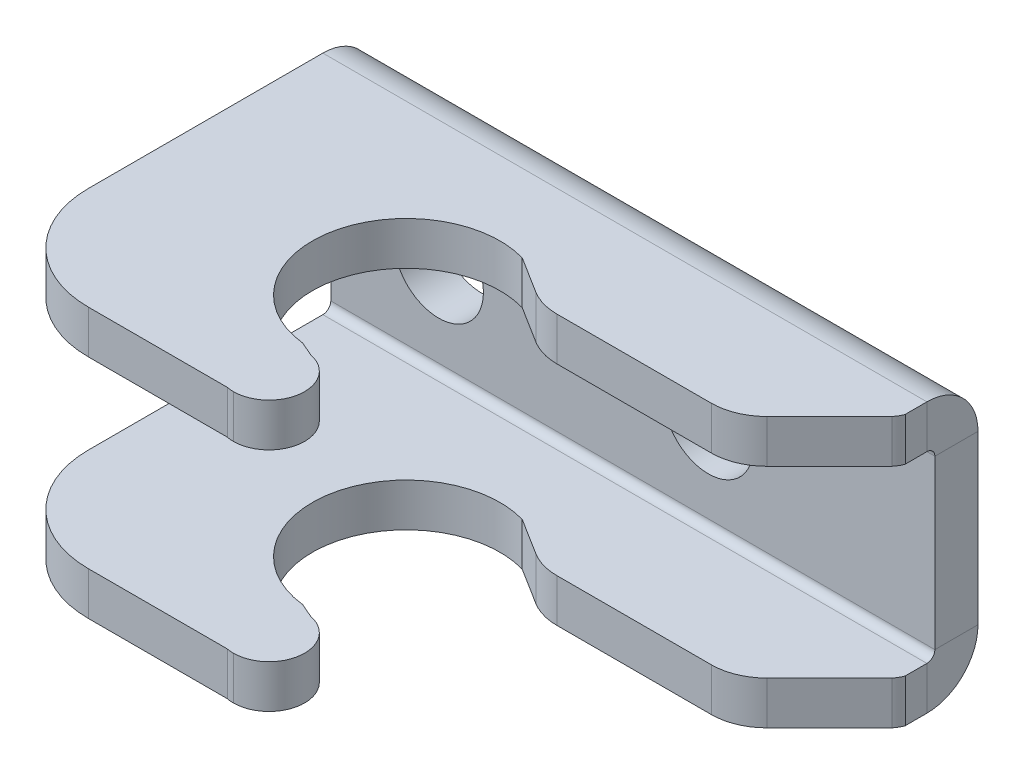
ISO-10303-21;
HEADER;
FILE_DESCRIPTION(('STEP AP214'),'2;1');
FILE_NAME('part.step','',(''),(''),'','','');
FILE_SCHEMA(('AUTOMOTIVE_DESIGN { 1 0 10303 214 1 1 1 1 }'));
ENDSEC;
DATA;
#1=APPLICATION_CONTEXT('core data for automotive mechanical design processes');
#2=APPLICATION_PROTOCOL_DEFINITION('international standard','automotive_design',2000,#1);
#3=PRODUCT_CONTEXT('',#1,'mechanical');
#4=PRODUCT('Part','Part','',(#3));
#5=PRODUCT_RELATED_PRODUCT_CATEGORY('part','',(#4));
#6=PRODUCT_DEFINITION_FORMATION('','',#4);
#7=PRODUCT_DEFINITION_CONTEXT('part definition',#1,'design');
#8=PRODUCT_DEFINITION('design','',#6,#7);
#9=PRODUCT_DEFINITION_SHAPE('','',#8);
#10=(LENGTH_UNIT() NAMED_UNIT(*) SI_UNIT(.MILLI.,.METRE.));
#11=(NAMED_UNIT(*) PLANE_ANGLE_UNIT() SI_UNIT($,.RADIAN.));
#12=(NAMED_UNIT(*) SI_UNIT($,.STERADIAN.) SOLID_ANGLE_UNIT());
#13=UNCERTAINTY_MEASURE_WITH_UNIT(LENGTH_MEASURE(1.E-05),#10,'distance_accuracy_value','');
#14=(GEOMETRIC_REPRESENTATION_CONTEXT(3) GLOBAL_UNCERTAINTY_ASSIGNED_CONTEXT((#13)) GLOBAL_UNIT_ASSIGNED_CONTEXT((#10,
#11,#12)) REPRESENTATION_CONTEXT('',''));
#15=CARTESIAN_POINT('',(0.,0.,0.));
#16=DIRECTION('',(0.,0.,1.));
#17=DIRECTION('',(1.,0.,0.));
#18=AXIS2_PLACEMENT_3D('',#15,#16,#17);
#19=CARTESIAN_POINT('',(13.0374425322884,8.5,32.7633807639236));
#20=DIRECTION('',(0.,1.,0.));
#21=DIRECTION('',(0.,0.,1.));
#22=AXIS2_PLACEMENT_3D('',#19,#20,#21);
#23=CYLINDRICAL_SURFACE('',#22,3.29825335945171);
#24=CARTESIAN_POINT('',(13.0374425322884,8.5,32.7633807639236));
#25=DIRECTION('',(0.,1.,0.));
#26=DIRECTION('',(0.,0.,-1.));
#27=AXIS2_PLACEMENT_3D('',#24,#25,#26);
#28=CIRCLE('',#27,3.29825335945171);
#29=CARTESIAN_POINT('',(12.4027999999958,8.5,36.));
#30=VERTEX_POINT('',#29);
#31=CARTESIAN_POINT('',(13.0374425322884,8.50000000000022,36.0616341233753));
#32=VERTEX_POINT('',#31);
#33=EDGE_CURVE('E9',#30,#32,#28,.T.);
#34=ORIENTED_EDGE('',*,*,#33,.T.);
#35=DIRECTION('',(0.,1.,0.));
#36=VECTOR('',#35,1.);
#37=CARTESIAN_POINT('',(13.0374425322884,8.50000000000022,36.0616341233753));
#38=LINE('',#37,#36);
#39=CARTESIAN_POINT('',(13.0374425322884,12.5,36.0616341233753));
#40=VERTEX_POINT('',#39);
#41=EDGE_CURVE('E25',#32,#40,#38,.T.);
#42=ORIENTED_EDGE('',*,*,#41,.T.);
#43=CARTESIAN_POINT('',(13.0374425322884,12.5,32.7633807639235));
#44=DIRECTION('',(0.,1.,0.));
#45=DIRECTION('',(0.,0.,-1.));
#46=AXIS2_PLACEMENT_3D('',#43,#44,#45);
#47=CIRCLE('',#46,3.29825335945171);
#48=CARTESIAN_POINT('',(12.4027999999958,12.5,36.));
#49=VERTEX_POINT('',#48);
#50=EDGE_CURVE('E417',#49,#40,#47,.T.);
#51=ORIENTED_EDGE('',*,*,#50,.F.);
#52=DIRECTION('',(0.,1.,0.));
#53=VECTOR('',#52,1.);
#54=CARTESIAN_POINT('',(12.4027999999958,8.5,36.));
#55=LINE('',#54,#53);
#56=EDGE_CURVE('E519',#30,#49,#55,.T.);
#57=ORIENTED_EDGE('',*,*,#56,.F.);
#58=EDGE_LOOP('',(#34,#42,#51,#57));
#59=FACE_BOUND('',#58,.T.);
#60=ADVANCED_FACE('F14',(#59),#23,.T.);
#61=CARTESIAN_POINT('',(13.0374425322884,-8.5,32.7633807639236));
#62=DIRECTION('',(0.,-1.,0.));
#63=DIRECTION('',(0.,0.,1.));
#64=AXIS2_PLACEMENT_3D('',#61,#62,#63);
#65=CYLINDRICAL_SURFACE('',#64,3.29825335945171);
#66=CARTESIAN_POINT('',(13.0374425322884,-8.5,32.7633807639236));
#67=DIRECTION('',(0.,1.,0.));
#68=DIRECTION('',(0.,0.,-1.));
#69=AXIS2_PLACEMENT_3D('',#66,#67,#68);
#70=CIRCLE('',#69,3.29825335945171);
#71=CARTESIAN_POINT('',(13.0374425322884,-8.5,36.0616341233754));
#72=VERTEX_POINT('',#71);
#73=CARTESIAN_POINT('',(13.6720850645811,-8.5,29.5267615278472));
#74=VERTEX_POINT('',#73);
#75=EDGE_CURVE('E485',#72,#74,#70,.T.);
#76=ORIENTED_EDGE('',*,*,#75,.F.);
#77=DIRECTION('',(0.,-1.,0.));
#78=VECTOR('',#77,1.);
#79=CARTESIAN_POINT('',(13.0374425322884,-8.5,36.0616341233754));
#80=LINE('',#79,#78);
#81=CARTESIAN_POINT('',(13.0374425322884,-12.5,36.0616341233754));
#82=VERTEX_POINT('',#81);
#83=EDGE_CURVE('E366',#72,#82,#80,.T.);
#84=ORIENTED_EDGE('',*,*,#83,.T.);
#85=CARTESIAN_POINT('',(13.0374425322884,-12.5,32.7633807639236));
#86=DIRECTION('',(0.,1.,0.));
#87=DIRECTION('',(0.,0.,-1.));
#88=AXIS2_PLACEMENT_3D('',#85,#86,#87);
#89=CIRCLE('',#88,3.29825335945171);
#90=CARTESIAN_POINT('',(13.6720850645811,-12.5,29.5267615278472));
#91=VERTEX_POINT('',#90);
#92=EDGE_CURVE('E362',#82,#91,#89,.T.);
#93=ORIENTED_EDGE('',*,*,#92,.T.);
#94=DIRECTION('',(0.,-1.,0.));
#95=VECTOR('',#94,1.);
#96=CARTESIAN_POINT('',(13.6720850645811,-8.5,29.5267615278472));
#97=LINE('',#96,#95);
#98=EDGE_CURVE('E566',#74,#91,#97,.T.);
#99=ORIENTED_EDGE('',*,*,#98,.F.);
#100=EDGE_LOOP('',(#76,#84,#93,#99));
#101=FACE_BOUND('',#100,.T.);
#102=ADVANCED_FACE('F953',(#101),#65,.T.);
#103=CARTESIAN_POINT('',(46.,-8.5,6.7366));
#104=DIRECTION('',(0.,0.,-1.));
#105=DIRECTION('',(0.,-1.,0.));
#106=AXIS2_PLACEMENT_3D('',#103,#104,#105);
#107=PLANE('',#106);
#108=DIRECTION('',(1.,0.,0.));
#109=VECTOR('',#108,1.);
#110=CARTESIAN_POINT('',(46.,-8.5,6.7366));
#111=LINE('',#110,#109);
#112=CARTESIAN_POINT('',(46.,-8.5,6.7366));
#113=VERTEX_POINT('',#112);
#114=CARTESIAN_POINT('',(46.0102060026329,-8.5,6.7366));
#115=VERTEX_POINT('',#114);
#116=EDGE_CURVE('E367',#113,#115,#111,.T.);
#117=ORIENTED_EDGE('',*,*,#116,.T.);
#118=DIRECTION('',(0.,-1.,0.));
#119=VECTOR('',#118,1.);
#120=CARTESIAN_POINT('',(46.0102060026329,-8.5,6.7366));
#121=LINE('',#120,#119);
#122=CARTESIAN_POINT('',(46.0102060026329,-12.5,6.7366));
#123=VERTEX_POINT('',#122);
#124=EDGE_CURVE('E459',#115,#123,#121,.T.);
#125=ORIENTED_EDGE('',*,*,#124,.T.);
#126=DIRECTION('',(-1.,0.,0.));
#127=VECTOR('',#126,1.);
#128=CARTESIAN_POINT('',(-0.475,-12.5,6.7366));
#129=LINE('',#128,#127);
#130=CARTESIAN_POINT('',(46.,-12.5,6.7366));
#131=VERTEX_POINT('',#130);
#132=EDGE_CURVE('E463',#123,#131,#129,.T.);
#133=ORIENTED_EDGE('',*,*,#132,.T.);
#134=DIRECTION('',(0.,-1.,0.));
#135=VECTOR('',#134,1.);
#136=CARTESIAN_POINT('',(46.,-8.5,6.7366));
#137=LINE('',#136,#135);
#138=EDGE_CURVE('E393',#113,#131,#137,.T.);
#139=ORIENTED_EDGE('',*,*,#138,.F.);
#140=EDGE_LOOP('',(#117,#125,#133,#139));
#141=FACE_BOUND('',#140,.T.);
#142=ADVANCED_FACE('F1002',(#141),#107,.T.);
#143=CARTESIAN_POINT('',(43.6124432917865,-8.5,5.89854631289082));
#144=DIRECTION('',(0.,-1.,0.));
#145=DIRECTION('',(0.,0.,1.));
#146=AXIS2_PLACEMENT_3D('',#143,#144,#145);
#147=CYLINDRICAL_SURFACE('',#146,2.54000000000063);
#148=ORIENTED_EDGE('',*,*,#124,.F.);
#149=CARTESIAN_POINT('',(43.6124432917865,-8.5,5.89854631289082));
#150=DIRECTION('',(0.,1.,0.));
#151=DIRECTION('',(0.,0.,-1.));
#152=AXIS2_PLACEMENT_3D('',#149,#150,#151);
#153=CIRCLE('',#152,2.54000000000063);
#154=CARTESIAN_POINT('',(45.5600523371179,-8.5,7.5290121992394));
#155=VERTEX_POINT('',#154);
#156=EDGE_CURVE('E440',#155,#115,#153,.T.);
#157=ORIENTED_EDGE('',*,*,#156,.F.);
#158=DIRECTION('',(0.,-1.,0.));
#159=VECTOR('',#158,1.);
#160=CARTESIAN_POINT('',(45.5600523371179,-8.5,7.5290121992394));
#161=LINE('',#160,#159);
#162=CARTESIAN_POINT('',(45.5600523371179,-12.5,7.5290121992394));
#163=VERTEX_POINT('',#162);
#164=EDGE_CURVE('E628',#155,#163,#161,.T.);
#165=ORIENTED_EDGE('',*,*,#164,.T.);
#166=CARTESIAN_POINT('',(43.6124432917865,-12.5,5.89854631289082));
#167=DIRECTION('',(0.,1.,0.));
#168=DIRECTION('',(0.,0.,-1.));
#169=AXIS2_PLACEMENT_3D('',#166,#167,#168);
#170=CIRCLE('',#169,2.54000000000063);
#171=EDGE_CURVE('E355',#163,#123,#170,.T.);
#172=ORIENTED_EDGE('',*,*,#171,.T.);
#173=EDGE_LOOP('',(#148,#157,#165,#172));
#174=FACE_BOUND('',#173,.T.);
#175=ADVANCED_FACE('F854',(#174),#147,.T.);
#176=CARTESIAN_POINT('',(46.,-8.5,1.63889215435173));
#177=DIRECTION('',(-1.,0.,0.));
#178=DIRECTION('',(0.,1.,0.));
#179=AXIS2_PLACEMENT_3D('',#176,#177,#178);
#180=PLANE('',#179);
#181=DIRECTION('',(0.,-1.,0.));
#182=VECTOR('',#181,1.);
#183=CARTESIAN_POINT('',(46.,-8.5,4.7366));
#184=LINE('',#183,#182);
#185=CARTESIAN_POINT('',(46.,-8.5,4.7366));
#186=VERTEX_POINT('',#185);
#187=CARTESIAN_POINT('',(46.,-12.5,4.7366));
#188=VERTEX_POINT('',#187);
#189=EDGE_CURVE('E464',#186,#188,#184,.T.);
#190=ORIENTED_EDGE('',*,*,#189,.F.);
#191=DIRECTION('',(0.,0.,-1.));
#192=VECTOR('',#191,1.);
#193=CARTESIAN_POINT('',(46.,-8.5,1.63889215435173));
#194=LINE('',#193,#192);
#195=EDGE_CURVE('E555',#113,#186,#194,.T.);
#196=ORIENTED_EDGE('',*,*,#195,.F.);
#197=ORIENTED_EDGE('',*,*,#138,.T.);
#198=DIRECTION('',(0.,0.,-1.));
#199=VECTOR('',#198,1.);
#200=CARTESIAN_POINT('',(46.,-12.5,1.63889215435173));
#201=LINE('',#200,#199);
#202=EDGE_CURVE('E387',#131,#188,#201,.T.);
#203=ORIENTED_EDGE('',*,*,#202,.T.);
#204=EDGE_LOOP('',(#190,#196,#197,#203));
#205=FACE_BOUND('',#204,.T.);
#206=ADVANCED_FACE('F872',(#205),#180,.F.);
#207=CARTESIAN_POINT('',(-10.,-8.5,26.275));
#208=DIRECTION('',(1.,0.,0.));
#209=DIRECTION('',(0.,0.,-1.));
#210=AXIS2_PLACEMENT_3D('',#207,#208,#209);
#211=PLANE('',#210);
#212=DIRECTION('',(0.,-1.,0.));
#213=VECTOR('',#212,1.);
#214=CARTESIAN_POINT('',(-10.,-8.5,4.7366));
#215=LINE('',#214,#213);
#216=CARTESIAN_POINT('',(-10.,-8.5,4.7366));
#217=VERTEX_POINT('',#216);
#218=CARTESIAN_POINT('',(-10.,-12.5,4.7366));
#219=VERTEX_POINT('',#218);
#220=EDGE_CURVE('E383',#217,#219,#215,.T.);
#221=ORIENTED_EDGE('',*,*,#220,.T.);
#222=DIRECTION('',(0.,0.,1.));
#223=VECTOR('',#222,1.);
#224=CARTESIAN_POINT('',(-10.,-12.5,26.275));
#225=LINE('',#224,#223);
#226=CARTESIAN_POINT('',(-10.,-12.5,26.475));
#227=VERTEX_POINT('',#226);
#228=EDGE_CURVE('E388',#219,#227,#225,.T.);
#229=ORIENTED_EDGE('',*,*,#228,.T.);
#230=DIRECTION('',(0.,-1.,0.));
#231=VECTOR('',#230,1.);
#232=CARTESIAN_POINT('',(-10.,-8.5,26.475));
#233=LINE('',#232,#231);
#234=CARTESIAN_POINT('',(-10.,-8.5,26.475));
#235=VERTEX_POINT('',#234);
#236=EDGE_CURVE('E574',#235,#227,#233,.T.);
#237=ORIENTED_EDGE('',*,*,#236,.F.);
#238=DIRECTION('',(0.,0.,1.));
#239=VECTOR('',#238,1.);
#240=CARTESIAN_POINT('',(-10.,-8.5,26.275));
#241=LINE('',#240,#239);
#242=EDGE_CURVE('E551',#217,#235,#241,.T.);
#243=ORIENTED_EDGE('',*,*,#242,.F.);
#244=EDGE_LOOP('',(#221,#229,#237,#243));
#245=FACE_BOUND('',#244,.T.);
#246=ADVANCED_FACE('F877',(#245),#211,.F.);
#247=CARTESIAN_POINT('',(-0.475,-8.5,26.475));
#248=DIRECTION('',(0.,1.,0.));
#249=DIRECTION('',(-1.,0.,0.));
#250=AXIS2_PLACEMENT_3D('',#247,#248,#249);
#251=PLANE('',#250);
#252=ORIENTED_EDGE('',*,*,#195,.T.);
#253=DIRECTION('',(1.,0.,0.));
#254=VECTOR('',#253,1.);
#255=CARTESIAN_POINT('',(-10.,-8.5,4.7366));
#256=LINE('',#255,#254);
#257=EDGE_CURVE('E532',#217,#186,#256,.T.);
#258=ORIENTED_EDGE('',*,*,#257,.F.);
#259=ORIENTED_EDGE('',*,*,#242,.T.);
#260=CARTESIAN_POINT('',(-0.475,-8.5,26.475));
#261=DIRECTION('',(0.,1.,0.));
#262=DIRECTION('',(0.,0.,-1.));
#263=AXIS2_PLACEMENT_3D('',#260,#261,#262);
#264=CIRCLE('',#263,9.525);
#265=CARTESIAN_POINT('',(-0.475,-8.5,36.));
#266=VERTEX_POINT('',#265);
#267=EDGE_CURVE('E556',#235,#266,#264,.T.);
#268=ORIENTED_EDGE('',*,*,#267,.T.);
#269=DIRECTION('',(1.,0.,0.));
#270=VECTOR('',#269,1.);
#271=CARTESIAN_POINT('',(12.4027999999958,-8.5,36.));
#272=LINE('',#271,#270);
#273=CARTESIAN_POINT('',(12.4027999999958,-8.5,36.));
#274=VERTEX_POINT('',#273);
#275=EDGE_CURVE('E548',#266,#274,#272,.T.);
#276=ORIENTED_EDGE('',*,*,#275,.T.);
#277=CARTESIAN_POINT('',(13.0374425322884,-8.5,32.7633807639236));
#278=DIRECTION('',(0.,1.,0.));
#279=DIRECTION('',(0.,0.,-1.));
#280=AXIS2_PLACEMENT_3D('',#277,#278,#279);
#281=CIRCLE('',#280,3.29825335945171);
#282=EDGE_CURVE('E544',#274,#72,#281,.T.);
#283=ORIENTED_EDGE('',*,*,#282,.T.);
#284=ORIENTED_EDGE('',*,*,#75,.T.);
#285=DIRECTION('',(-0.91749887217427,0.,-0.397738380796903));
#286=VECTOR('',#285,1.);
#287=CARTESIAN_POINT('',(13.6720850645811,-8.5,29.5267615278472));
#288=LINE('',#287,#286);
#289=CARTESIAN_POINT('',(12.3352961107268,-8.5,28.9472596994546));
#290=VERTEX_POINT('',#289);
#291=EDGE_CURVE('E481',#74,#290,#288,.T.);
#292=ORIENTED_EDGE('',*,*,#291,.T.);
#293=CARTESIAN_POINT('',(13.2917999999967,-8.5,20.3));
#294=DIRECTION('',(0.,-1.,0.));
#295=DIRECTION('',(0.,0.,-1.));
#296=AXIS2_PLACEMENT_3D('',#293,#294,#295);
#297=CIRCLE('',#296,8.7);
#298=CARTESIAN_POINT('',(15.6844512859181,-8.5,11.9354785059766));
#299=VERTEX_POINT('',#298);
#300=EDGE_CURVE('E486',#290,#299,#297,.T.);
#301=ORIENTED_EDGE('',*,*,#300,.T.);
#302=DIRECTION('',(0.84713861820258,0.,0.531371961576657));
#303=VECTOR('',#302,1.);
#304=CARTESIAN_POINT('',(15.6844512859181,-8.5,11.9354785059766));
#305=LINE('',#304,#303);
#306=CARTESIAN_POINT('',(19.0931873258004,-8.5,14.0736253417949));
#307=VERTEX_POINT('',#306);
#308=EDGE_CURVE('E490',#299,#307,#305,.T.);
#309=ORIENTED_EDGE('',*,*,#308,.T.);
#310=CARTESIAN_POINT('',(21.7979410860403,-8.5,9.68378416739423));
#311=DIRECTION('',(0.,1.,0.));
#312=DIRECTION('',(0.,0.,-1.));
#313=AXIS2_PLACEMENT_3D('',#310,#311,#312);
#314=CIRCLE('',#313,5.15619999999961);
#315=CARTESIAN_POINT('',(21.7979410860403,-8.5,14.8399841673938));
#316=VERTEX_POINT('',#315);
#317=EDGE_CURVE('E743',#307,#316,#314,.T.);
#318=ORIENTED_EDGE('',*,*,#317,.T.);
#319=DIRECTION('',(1.,0.,0.));
#320=VECTOR('',#319,1.);
#321=CARTESIAN_POINT('',(21.7979410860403,-8.5,14.8399841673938));
#322=LINE('',#321,#320);
#323=CARTESIAN_POINT('',(36.1133123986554,-8.5,14.8399841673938));
#324=VERTEX_POINT('',#323);
#325=EDGE_CURVE('E720',#316,#324,#322,.T.);
#326=ORIENTED_EDGE('',*,*,#325,.T.);
#327=CARTESIAN_POINT('',(36.1133123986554,-8.5,9.68378416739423));
#328=DIRECTION('',(0.,1.,0.));
#329=DIRECTION('',(0.,0.,-1.));
#330=AXIS2_PLACEMENT_3D('',#327,#328,#329);
#331=CIRCLE('',#330,5.15619999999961);
#332=CARTESIAN_POINT('',(39.7592963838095,-8.5,13.3297681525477));
#333=VERTEX_POINT('',#332);
#334=EDGE_CURVE('E716',#324,#333,#331,.T.);
#335=ORIENTED_EDGE('',*,*,#334,.T.);
#336=DIRECTION('',(0.707106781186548,0.,-0.707106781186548));
#337=VECTOR('',#336,1.);
#338=CARTESIAN_POINT('',(45.5600523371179,-8.5,7.5290121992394));
#339=LINE('',#338,#337);
#340=EDGE_CURVE('E721',#333,#155,#339,.T.);
#341=ORIENTED_EDGE('',*,*,#340,.T.);
#342=ORIENTED_EDGE('',*,*,#156,.T.);
#343=ORIENTED_EDGE('',*,*,#116,.F.);
#344=EDGE_LOOP('',(#252,#258,#259,#268,#276,#283,#284,#292,#301,#309,#318,#326,#335,#341,#342,#343));
#345=FACE_BOUND('',#344,.T.);
#346=ADVANCED_FACE('F645',(#345),#251,.T.);
#347=CARTESIAN_POINT('',(-0.475,-12.5,26.475));
#348=DIRECTION('',(0.,1.,0.));
#349=DIRECTION('',(-1.,0.,0.));
#350=AXIS2_PLACEMENT_3D('',#347,#348,#349);
#351=PLANE('',#350);
#352=DIRECTION('',(1.,0.,0.));
#353=VECTOR('',#352,1.);
#354=CARTESIAN_POINT('',(-10.,-12.5,4.7366));
#355=LINE('',#354,#353);
#356=EDGE_CURVE('E436',#219,#188,#355,.T.);
#357=ORIENTED_EDGE('',*,*,#356,.T.);
#358=ORIENTED_EDGE('',*,*,#202,.F.);
#359=ORIENTED_EDGE('',*,*,#132,.F.);
#360=ORIENTED_EDGE('',*,*,#171,.F.);
#361=DIRECTION('',(0.707106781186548,0.,-0.707106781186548));
#362=VECTOR('',#361,1.);
#363=CARTESIAN_POINT('',(45.5600523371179,-12.5,7.5290121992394));
#364=LINE('',#363,#362);
#365=CARTESIAN_POINT('',(39.7592963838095,-12.5,13.3297681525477));
#366=VERTEX_POINT('',#365);
#367=EDGE_CURVE('E739',#366,#163,#364,.T.);
#368=ORIENTED_EDGE('',*,*,#367,.F.);
#369=CARTESIAN_POINT('',(36.1133123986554,-12.5,9.68378416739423));
#370=DIRECTION('',(0.,1.,0.));
#371=DIRECTION('',(0.,0.,-1.));
#372=AXIS2_PLACEMENT_3D('',#369,#370,#371);
#373=CIRCLE('',#372,5.15619999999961);
#374=CARTESIAN_POINT('',(36.1133123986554,-12.5,14.8399841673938));
#375=VERTEX_POINT('',#374);
#376=EDGE_CURVE('E18',#375,#366,#373,.T.);
#377=ORIENTED_EDGE('',*,*,#376,.F.);
#378=DIRECTION('',(1.,0.,0.));
#379=VECTOR('',#378,1.);
#380=CARTESIAN_POINT('',(21.7979410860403,-12.5,14.8399841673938));
#381=LINE('',#380,#379);
#382=CARTESIAN_POINT('',(21.7979410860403,-12.5,14.8399841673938));
#383=VERTEX_POINT('',#382);
#384=EDGE_CURVE('E579',#383,#375,#381,.T.);
#385=ORIENTED_EDGE('',*,*,#384,.F.);
#386=CARTESIAN_POINT('',(21.7979410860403,-12.5,9.68378416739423));
#387=DIRECTION('',(0.,1.,0.));
#388=DIRECTION('',(0.,0.,-1.));
#389=AXIS2_PLACEMENT_3D('',#386,#387,#388);
#390=CIRCLE('',#389,5.15619999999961);
#391=CARTESIAN_POINT('',(19.0931873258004,-12.5,14.0736253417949));
#392=VERTEX_POINT('',#391);
#393=EDGE_CURVE('E373',#392,#383,#390,.T.);
#394=ORIENTED_EDGE('',*,*,#393,.F.);
#395=DIRECTION('',(0.84713861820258,0.,0.531371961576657));
#396=VECTOR('',#395,1.);
#397=CARTESIAN_POINT('',(15.6844512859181,-12.5,11.9354785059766));
#398=LINE('',#397,#396);
#399=CARTESIAN_POINT('',(15.6844512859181,-12.5,11.9354785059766));
#400=VERTEX_POINT('',#399);
#401=EDGE_CURVE('E372',#400,#392,#398,.T.);
#402=ORIENTED_EDGE('',*,*,#401,.F.);
#403=CARTESIAN_POINT('',(13.2917999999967,-12.5,20.3));
#404=DIRECTION('',(0.,-1.,0.));
#405=DIRECTION('',(0.,0.,-1.));
#406=AXIS2_PLACEMENT_3D('',#403,#404,#405);
#407=CIRCLE('',#406,8.7);
#408=CARTESIAN_POINT('',(12.3352961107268,-12.5,28.9472596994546));
#409=VERTEX_POINT('',#408);
#410=EDGE_CURVE('E562',#409,#400,#407,.T.);
#411=ORIENTED_EDGE('',*,*,#410,.F.);
#412=DIRECTION('',(-0.91749887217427,0.,-0.397738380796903));
#413=VECTOR('',#412,1.);
#414=CARTESIAN_POINT('',(13.6720850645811,-12.5,29.5267615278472));
#415=LINE('',#414,#413);
#416=EDGE_CURVE('E428',#91,#409,#415,.T.);
#417=ORIENTED_EDGE('',*,*,#416,.F.);
#418=ORIENTED_EDGE('',*,*,#92,.F.);
#419=CARTESIAN_POINT('',(13.0374425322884,-12.5,32.7633807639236));
#420=DIRECTION('',(0.,1.,0.));
#421=DIRECTION('',(0.,0.,-1.));
#422=AXIS2_PLACEMENT_3D('',#419,#420,#421);
#423=CIRCLE('',#422,3.29825335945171);
#424=CARTESIAN_POINT('',(12.4027999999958,-12.5,36.));
#425=VERTEX_POINT('',#424);
#426=EDGE_CURVE('E424',#425,#82,#423,.T.);
#427=ORIENTED_EDGE('',*,*,#426,.F.);
#428=DIRECTION('',(1.,0.,0.));
#429=VECTOR('',#428,1.);
#430=CARTESIAN_POINT('',(12.4027999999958,-12.5,36.));
#431=LINE('',#430,#429);
#432=CARTESIAN_POINT('',(-0.475,-12.5,36.));
#433=VERTEX_POINT('',#432);
#434=EDGE_CURVE('E599',#433,#425,#431,.T.);
#435=ORIENTED_EDGE('',*,*,#434,.F.);
#436=CARTESIAN_POINT('',(-0.475,-12.5,26.475));
#437=DIRECTION('',(0.,1.,0.));
#438=DIRECTION('',(0.,0.,-1.));
#439=AXIS2_PLACEMENT_3D('',#436,#437,#438);
#440=CIRCLE('',#439,9.525);
#441=EDGE_CURVE('E441',#227,#433,#440,.T.);
#442=ORIENTED_EDGE('',*,*,#441,.F.);
#443=ORIENTED_EDGE('',*,*,#228,.F.);
#444=EDGE_LOOP('',(#357,#358,#359,#360,#368,#377,#385,#394,#402,#411,#417,#418,#427,#435,#442,#443));
#445=FACE_BOUND('',#444,.T.);
#446=ADVANCED_FACE('F861',(#445),#351,.F.);
#447=CARTESIAN_POINT('',(-0.475,-8.5,26.475));
#448=DIRECTION('',(0.,-1.,0.));
#449=DIRECTION('',(0.,0.,1.));
#450=AXIS2_PLACEMENT_3D('',#447,#448,#449);
#451=CYLINDRICAL_SURFACE('',#450,9.525);
#452=ORIENTED_EDGE('',*,*,#441,.T.);
#453=DIRECTION('',(0.,-1.,0.));
#454=VECTOR('',#453,1.);
#455=CARTESIAN_POINT('',(-0.475,-8.5,36.));
#456=LINE('',#455,#454);
#457=EDGE_CURVE('E595',#266,#433,#456,.T.);
#458=ORIENTED_EDGE('',*,*,#457,.F.);
#459=ORIENTED_EDGE('',*,*,#267,.F.);
#460=ORIENTED_EDGE('',*,*,#236,.T.);
#461=EDGE_LOOP('',(#452,#458,#459,#460));
#462=FACE_BOUND('',#461,.T.);
#463=ADVANCED_FACE('F984',(#462),#451,.T.);
#464=CARTESIAN_POINT('',(12.4027999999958,-8.5,36.));
#465=DIRECTION('',(0.,0.,-1.));
#466=DIRECTION('',(1.,0.,0.));
#467=AXIS2_PLACEMENT_3D('',#464,#465,#466);
#468=PLANE('',#467);
#469=ORIENTED_EDGE('',*,*,#434,.T.);
#470=DIRECTION('',(0.,-1.,0.));
#471=VECTOR('',#470,1.);
#472=CARTESIAN_POINT('',(12.4027999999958,-8.5,36.));
#473=LINE('',#472,#471);
#474=EDGE_CURVE('E427',#274,#425,#473,.T.);
#475=ORIENTED_EDGE('',*,*,#474,.F.);
#476=ORIENTED_EDGE('',*,*,#275,.F.);
#477=ORIENTED_EDGE('',*,*,#457,.T.);
#478=EDGE_LOOP('',(#469,#475,#476,#477));
#479=FACE_BOUND('',#478,.T.);
#480=ADVANCED_FACE('F1099',(#479),#468,.F.);
#481=CARTESIAN_POINT('',(13.0374425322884,-8.5,32.7633807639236));
#482=DIRECTION('',(0.,-1.,0.));
#483=DIRECTION('',(0.,0.,1.));
#484=AXIS2_PLACEMENT_3D('',#481,#482,#483);
#485=CYLINDRICAL_SURFACE('',#484,3.29825335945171);
#486=ORIENTED_EDGE('',*,*,#83,.F.);
#487=ORIENTED_EDGE('',*,*,#282,.F.);
#488=ORIENTED_EDGE('',*,*,#474,.T.);
#489=ORIENTED_EDGE('',*,*,#426,.T.);
#490=EDGE_LOOP('',(#486,#487,#488,#489));
#491=FACE_BOUND('',#490,.T.);
#492=ADVANCED_FACE('F892',(#491),#485,.T.);
#493=CARTESIAN_POINT('',(13.6720850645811,-8.5,29.5267615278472));
#494=DIRECTION('',(-0.397738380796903,0.,0.91749887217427));
#495=DIRECTION('',(0.,1.,0.));
#496=AXIS2_PLACEMENT_3D('',#493,#494,#495);
#497=PLANE('',#496);
#498=ORIENTED_EDGE('',*,*,#416,.T.);
#499=DIRECTION('',(0.,-1.,0.));
#500=VECTOR('',#499,1.);
#501=CARTESIAN_POINT('',(12.3352961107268,-8.5,28.9472596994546));
#502=LINE('',#501,#500);
#503=EDGE_CURVE('E392',#290,#409,#502,.T.);
#504=ORIENTED_EDGE('',*,*,#503,.F.);
#505=ORIENTED_EDGE('',*,*,#291,.F.);
#506=ORIENTED_EDGE('',*,*,#98,.T.);
#507=EDGE_LOOP('',(#498,#504,#505,#506));
#508=FACE_BOUND('',#507,.T.);
#509=ADVANCED_FACE('F886',(#508),#497,.F.);
#510=CARTESIAN_POINT('',(13.2917999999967,-8.5,20.3));
#511=DIRECTION('',(0.,-1.,0.));
#512=DIRECTION('',(0.,0.,1.));
#513=AXIS2_PLACEMENT_3D('',#510,#511,#512);
#514=CYLINDRICAL_SURFACE('',#513,8.7);
#515=ORIENTED_EDGE('',*,*,#410,.T.);
#516=DIRECTION('',(0.,-1.,0.));
#517=VECTOR('',#516,1.);
#518=CARTESIAN_POINT('',(15.6844512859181,-8.5,11.9354785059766));
#519=LINE('',#518,#517);
#520=EDGE_CURVE('E368',#299,#400,#519,.T.);
#521=ORIENTED_EDGE('',*,*,#520,.F.);
#522=ORIENTED_EDGE('',*,*,#300,.F.);
#523=ORIENTED_EDGE('',*,*,#503,.T.);
#524=EDGE_LOOP('',(#515,#521,#522,#523));
#525=FACE_BOUND('',#524,.T.);
#526=ADVANCED_FACE('F891',(#525),#514,.F.);
#527=CARTESIAN_POINT('',(15.6844512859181,-8.5,11.9354785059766));
#528=DIRECTION('',(0.531371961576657,0.,-0.84713861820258));
#529=DIRECTION('',(0.84713861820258,0.,0.531371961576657));
#530=AXIS2_PLACEMENT_3D('',#527,#528,#529);
#531=PLANE('',#530);
#532=ORIENTED_EDGE('',*,*,#401,.T.);
#533=DIRECTION('',(0.,-1.,0.));
#534=VECTOR('',#533,1.);
#535=CARTESIAN_POINT('',(19.0931873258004,-8.5,14.0736253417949));
#536=LINE('',#535,#534);
#537=EDGE_CURVE('E575',#307,#392,#536,.T.);
#538=ORIENTED_EDGE('',*,*,#537,.F.);
#539=ORIENTED_EDGE('',*,*,#308,.F.);
#540=ORIENTED_EDGE('',*,*,#520,.T.);
#541=EDGE_LOOP('',(#532,#538,#539,#540));
#542=FACE_BOUND('',#541,.T.);
#543=ADVANCED_FACE('F1122',(#542),#531,.F.);
#544=CARTESIAN_POINT('',(21.7979410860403,-8.5,9.68378416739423));
#545=DIRECTION('',(0.,-1.,0.));
#546=DIRECTION('',(0.,0.,1.));
#547=AXIS2_PLACEMENT_3D('',#544,#545,#546);
#548=CYLINDRICAL_SURFACE('',#547,5.15619999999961);
#549=ORIENTED_EDGE('',*,*,#393,.T.);
#550=DIRECTION('',(0.,-1.,0.));
#551=VECTOR('',#550,1.);
#552=CARTESIAN_POINT('',(21.7979410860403,-8.5,14.8399841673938));
#553=LINE('',#552,#551);
#554=EDGE_CURVE('E591',#316,#383,#553,.T.);
#555=ORIENTED_EDGE('',*,*,#554,.F.);
#556=ORIENTED_EDGE('',*,*,#317,.F.);
#557=ORIENTED_EDGE('',*,*,#537,.T.);
#558=EDGE_LOOP('',(#549,#555,#556,#557));
#559=FACE_BOUND('',#558,.T.);
#560=ADVANCED_FACE('F1116',(#559),#548,.T.);
#561=CARTESIAN_POINT('',(21.7979410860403,-8.5,14.8399841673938));
#562=DIRECTION('',(0.,0.,-1.));
#563=DIRECTION('',(1.,0.,0.));
#564=AXIS2_PLACEMENT_3D('',#561,#562,#563);
#565=PLANE('',#564);
#566=ORIENTED_EDGE('',*,*,#384,.T.);
#567=DIRECTION('',(0.,-1.,0.));
#568=VECTOR('',#567,1.);
#569=CARTESIAN_POINT('',(36.1133123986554,-8.5,14.8399841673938));
#570=LINE('',#569,#568);
#571=EDGE_CURVE('E752',#324,#375,#570,.T.);
#572=ORIENTED_EDGE('',*,*,#571,.F.);
#573=ORIENTED_EDGE('',*,*,#325,.F.);
#574=ORIENTED_EDGE('',*,*,#554,.T.);
#575=EDGE_LOOP('',(#566,#572,#573,#574));
#576=FACE_BOUND('',#575,.T.);
#577=ADVANCED_FACE('F1121',(#576),#565,.F.);
#578=CARTESIAN_POINT('',(36.1133123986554,-8.5,9.68378416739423));
#579=DIRECTION('',(0.,-1.,0.));
#580=DIRECTION('',(0.,0.,1.));
#581=AXIS2_PLACEMENT_3D('',#578,#579,#580);
#582=CYLINDRICAL_SURFACE('',#581,5.15619999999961);
#583=ORIENTED_EDGE('',*,*,#376,.T.);
#584=DIRECTION('',(0.,-1.,0.));
#585=VECTOR('',#584,1.);
#586=CARTESIAN_POINT('',(39.7592963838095,-8.5,13.3297681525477));
#587=LINE('',#586,#585);
#588=EDGE_CURVE('E467',#333,#366,#587,.T.);
#589=ORIENTED_EDGE('',*,*,#588,.F.);
#590=ORIENTED_EDGE('',*,*,#334,.F.);
#591=ORIENTED_EDGE('',*,*,#571,.T.);
#592=EDGE_LOOP('',(#583,#589,#590,#591));
#593=FACE_BOUND('',#592,.T.);
#594=ADVANCED_FACE('F16',(#593),#582,.T.);
#595=CARTESIAN_POINT('',(45.5600523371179,-8.5,7.5290121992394));
#596=DIRECTION('',(-0.707106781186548,0.,-0.707106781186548));
#597=DIRECTION('',(0.,-1.,0.));
#598=AXIS2_PLACEMENT_3D('',#595,#596,#597);
#599=PLANE('',#598);
#600=ORIENTED_EDGE('',*,*,#367,.T.);
#601=ORIENTED_EDGE('',*,*,#164,.F.);
#602=ORIENTED_EDGE('',*,*,#340,.F.);
#603=ORIENTED_EDGE('',*,*,#588,.T.);
#604=EDGE_LOOP('',(#600,#601,#602,#603));
#605=FACE_BOUND('',#604,.T.);
#606=ADVANCED_FACE('F857',(#605),#599,.F.);
#607=CARTESIAN_POINT('',(46.,-7.7634,4.7366));
#608=DIRECTION('',(1.,0.,0.));
#609=DIRECTION('',(0.,0.,-1.));
#610=AXIS2_PLACEMENT_3D('',#607,#608,#609);
#611=PLANE('',#610);
#612=DIRECTION('',(0.,0.,-1.));
#613=VECTOR('',#612,1.);
#614=CARTESIAN_POINT('',(46.,-7.7634,0.));
#615=LINE('',#614,#613);
#616=CARTESIAN_POINT('',(46.,-7.7634,4.));
#617=VERTEX_POINT('',#616);
#618=CARTESIAN_POINT('',(46.,-7.7634,0.));
#619=VERTEX_POINT('',#618);
#620=EDGE_CURVE('E455',#617,#619,#615,.T.);
#621=ORIENTED_EDGE('',*,*,#620,.F.);
#622=CARTESIAN_POINT('',(46.,-7.7634,4.7366));
#623=DIRECTION('',(1.,0.,0.));
#624=DIRECTION('',(0.,0.,1.));
#625=AXIS2_PLACEMENT_3D('',#622,#623,#624);
#626=CIRCLE('',#625,0.7366);
#627=EDGE_CURVE('E528',#186,#617,#626,.T.);
#628=ORIENTED_EDGE('',*,*,#627,.F.);
#629=ORIENTED_EDGE('',*,*,#189,.T.);
#630=CARTESIAN_POINT('',(46.,-7.7634,4.7366));
#631=DIRECTION('',(1.,0.,0.));
#632=DIRECTION('',(0.,0.,1.));
#633=AXIS2_PLACEMENT_3D('',#630,#631,#632);
#634=CIRCLE('',#633,4.7366);
#635=EDGE_CURVE('E468',#188,#619,#634,.T.);
#636=ORIENTED_EDGE('',*,*,#635,.T.);
#637=EDGE_LOOP('',(#621,#628,#629,#636));
#638=FACE_BOUND('',#637,.T.);
#639=ADVANCED_FACE('F651',(#638),#611,.T.);
#640=CARTESIAN_POINT('',(-10.,-7.7634,4.7366));
#641=DIRECTION('',(1.,0.,0.));
#642=DIRECTION('',(0.,0.,-1.));
#643=AXIS2_PLACEMENT_3D('',#640,#641,#642);
#644=PLANE('',#643);
#645=CARTESIAN_POINT('',(-10.,-7.7634,4.7366));
#646=DIRECTION('',(-1.,0.,0.));
#647=DIRECTION('',(0.,0.,1.));
#648=AXIS2_PLACEMENT_3D('',#645,#646,#647);
#649=CIRCLE('',#648,0.7366);
#650=CARTESIAN_POINT('',(-10.,-7.7634,4.));
#651=VERTEX_POINT('',#650);
#652=EDGE_CURVE('E256',#651,#217,#649,.T.);
#653=ORIENTED_EDGE('',*,*,#652,.F.);
#654=DIRECTION('',(0.,0.,-1.));
#655=VECTOR('',#654,1.);
#656=CARTESIAN_POINT('',(-10.,-7.7634,4.));
#657=LINE('',#656,#655);
#658=CARTESIAN_POINT('',(-10.,-7.7634,0.));
#659=VERTEX_POINT('',#658);
#660=EDGE_CURVE('E606',#651,#659,#657,.T.);
#661=ORIENTED_EDGE('',*,*,#660,.T.);
#662=CARTESIAN_POINT('',(-10.,-7.7634,4.7366));
#663=DIRECTION('',(-1.,0.,0.));
#664=DIRECTION('',(0.,0.,1.));
#665=AXIS2_PLACEMENT_3D('',#662,#663,#664);
#666=CIRCLE('',#665,4.7366);
#667=EDGE_CURVE('E755',#659,#219,#666,.T.);
#668=ORIENTED_EDGE('',*,*,#667,.T.);
#669=ORIENTED_EDGE('',*,*,#220,.F.);
#670=EDGE_LOOP('',(#653,#661,#668,#669));
#671=FACE_BOUND('',#670,.T.);
#672=ADVANCED_FACE('F964',(#671),#644,.F.);
#673=CARTESIAN_POINT('',(-10.,-7.7634,4.7366));
#674=DIRECTION('',(-1.,0.,0.));
#675=DIRECTION('',(0.,0.,-1.));
#676=AXIS2_PLACEMENT_3D('',#673,#674,#675);
#677=CYLINDRICAL_SURFACE('',#676,4.7366);
#678=ORIENTED_EDGE('',*,*,#356,.F.);
#679=ORIENTED_EDGE('',*,*,#667,.F.);
#680=DIRECTION('',(-1.,0.,0.));
#681=VECTOR('',#680,1.);
#682=CARTESIAN_POINT('',(46.,-7.7634,0.));
#683=LINE('',#682,#681);
#684=EDGE_CURVE('E240',#619,#659,#683,.T.);
#685=ORIENTED_EDGE('',*,*,#684,.F.);
#686=ORIENTED_EDGE('',*,*,#635,.F.);
#687=EDGE_LOOP('',(#678,#679,#685,#686));
#688=FACE_BOUND('',#687,.T.);
#689=ADVANCED_FACE('F1131',(#688),#677,.T.);
#690=CARTESIAN_POINT('',(-10.,-7.7634,4.7366));
#691=DIRECTION('',(-1.,0.,0.));
#692=DIRECTION('',(0.,0.,-1.));
#693=AXIS2_PLACEMENT_3D('',#690,#691,#692);
#694=CYLINDRICAL_SURFACE('',#693,0.7366);
#695=ORIENTED_EDGE('',*,*,#257,.T.);
#696=ORIENTED_EDGE('',*,*,#627,.T.);
#697=DIRECTION('',(-1.,0.,0.));
#698=VECTOR('',#697,1.);
#699=CARTESIAN_POINT('',(46.,-7.7634,4.));
#700=LINE('',#699,#698);
#701=EDGE_CURVE('E533',#617,#651,#700,.T.);
#702=ORIENTED_EDGE('',*,*,#701,.T.);
#703=ORIENTED_EDGE('',*,*,#652,.T.);
#704=EDGE_LOOP('',(#695,#696,#702,#703));
#705=FACE_BOUND('',#704,.T.);
#706=ADVANCED_FACE('F654',(#705),#694,.F.);
#707=CARTESIAN_POINT('',(-10.,0.,0.));
#708=DIRECTION('',(1.,0.,0.));
#709=DIRECTION('',(0.,0.,-1.));
#710=AXIS2_PLACEMENT_3D('',#707,#708,#709);
#711=PLANE('',#710);
#712=ORIENTED_EDGE('',*,*,#660,.F.);
#713=DIRECTION('',(0.,1.,0.));
#714=VECTOR('',#713,1.);
#715=CARTESIAN_POINT('',(-10.,0.,4.));
#716=LINE('',#715,#714);
#717=CARTESIAN_POINT('',(-10.,7.7634,3.99999999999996));
#718=VERTEX_POINT('',#717);
#719=EDGE_CURVE('E728',#651,#718,#716,.T.);
#720=ORIENTED_EDGE('',*,*,#719,.T.);
#721=DIRECTION('',(0.,0.,-1.));
#722=VECTOR('',#721,1.);
#723=CARTESIAN_POINT('',(-10.,7.7634,3.99999999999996));
#724=LINE('',#723,#722);
#725=CARTESIAN_POINT('',(-10.,7.7634,0.));
#726=VERTEX_POINT('',#725);
#727=EDGE_CURVE('E732',#718,#726,#724,.T.);
#728=ORIENTED_EDGE('',*,*,#727,.T.);
#729=DIRECTION('',(0.,1.,0.));
#730=VECTOR('',#729,1.);
#731=CARTESIAN_POINT('',(-10.,-8.5,0.));
#732=LINE('',#731,#730);
#733=EDGE_CURVE('E507',#659,#726,#732,.T.);
#734=ORIENTED_EDGE('',*,*,#733,.F.);
#735=EDGE_LOOP('',(#712,#720,#728,#734));
#736=FACE_BOUND('',#735,.T.);
#737=ADVANCED_FACE('F822',(#736),#711,.F.);
#738=CARTESIAN_POINT('',(46.,-8.5,0.));
#739=DIRECTION('',(-1.,0.,0.));
#740=DIRECTION('',(0.,1.,0.));
#741=AXIS2_PLACEMENT_3D('',#738,#739,#740);
#742=PLANE('',#741);
#743=ORIENTED_EDGE('',*,*,#620,.T.);
#744=DIRECTION('',(0.,-1.,0.));
#745=VECTOR('',#744,1.);
#746=CARTESIAN_POINT('',(46.,-8.5,0.));
#747=LINE('',#746,#745);
#748=CARTESIAN_POINT('',(46.,7.7634,0.));
#749=VERTEX_POINT('',#748);
#750=EDGE_CURVE('E456',#749,#619,#747,.T.);
#751=ORIENTED_EDGE('',*,*,#750,.F.);
#752=DIRECTION('',(0.,0.,-1.));
#753=VECTOR('',#752,1.);
#754=CARTESIAN_POINT('',(46.,7.7634,0.));
#755=LINE('',#754,#753);
#756=CARTESIAN_POINT('',(46.,7.7634,3.99999999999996));
#757=VERTEX_POINT('',#756);
#758=EDGE_CURVE('E494',#757,#749,#755,.T.);
#759=ORIENTED_EDGE('',*,*,#758,.F.);
#760=DIRECTION('',(0.,-1.,0.));
#761=VECTOR('',#760,1.);
#762=CARTESIAN_POINT('',(46.,-8.5,4.));
#763=LINE('',#762,#761);
#764=EDGE_CURVE('E451',#757,#617,#763,.T.);
#765=ORIENTED_EDGE('',*,*,#764,.T.);
#766=EDGE_LOOP('',(#743,#751,#759,#765));
#767=FACE_BOUND('',#766,.T.);
#768=ADVANCED_FACE('F659',(#767),#742,.F.);
#769=CARTESIAN_POINT('',(46.,-8.5,0.));
#770=DIRECTION('',(0.,0.,-1.));
#771=DIRECTION('',(0.,-1.,0.));
#772=AXIS2_PLACEMENT_3D('',#769,#770,#771);
#773=PLANE('',#772);
#774=CARTESIAN_POINT('',(0.,0.,0.));
#775=DIRECTION('',(0.,0.,-1.));
#776=DIRECTION('',(0.,1.,0.));
#777=AXIS2_PLACEMENT_3D('',#774,#775,#776);
#778=CIRCLE('',#777,4.15);
#779=CARTESIAN_POINT('',(0.,4.15,0.));
#780=VERTEX_POINT('',#779);
#781=EDGE_CURVE('E435',#780,#780,#778,.T.);
#782=ORIENTED_EDGE('',*,*,#781,.F.);
#783=EDGE_LOOP('',(#782));
#784=FACE_BOUND('',#783,.T.);
#785=CARTESIAN_POINT('',(25.,0.,0.));
#786=DIRECTION('',(0.,0.,-1.));
#787=DIRECTION('',(0.,1.,0.));
#788=AXIS2_PLACEMENT_3D('',#785,#786,#787);
#789=CIRCLE('',#788,4.15);
#790=CARTESIAN_POINT('',(25.,4.15,0.));
#791=VERTEX_POINT('',#790);
#792=EDGE_CURVE('E1586',#791,#791,#789,.T.);
#793=ORIENTED_EDGE('',*,*,#792,.F.);
#794=EDGE_LOOP('',(#793));
#795=FACE_BOUND('',#794,.T.);
#796=ORIENTED_EDGE('',*,*,#750,.T.);
#797=ORIENTED_EDGE('',*,*,#684,.T.);
#798=ORIENTED_EDGE('',*,*,#733,.T.);
#799=DIRECTION('',(-1.,0.,0.));
#800=VECTOR('',#799,1.);
#801=CARTESIAN_POINT('',(46.,7.7634,0.));
#802=LINE('',#801,#800);
#803=EDGE_CURVE('E434',#749,#726,#802,.T.);
#804=ORIENTED_EDGE('',*,*,#803,.F.);
#805=EDGE_LOOP('',(#796,#797,#798,#804));
#806=FACE_BOUND('',#805,.T.);
#807=ADVANCED_FACE('F819',(#784,#795,#806),#773,.T.);
#808=CARTESIAN_POINT('',(46.,-8.5,4.));
#809=DIRECTION('',(0.,0.,-1.));
#810=DIRECTION('',(0.,-1.,0.));
#811=AXIS2_PLACEMENT_3D('',#808,#809,#810);
#812=PLANE('',#811);
#813=CARTESIAN_POINT('',(0.,0.,4.));
#814=DIRECTION('',(0.,0.,1.));
#815=DIRECTION('',(1.,0.,0.));
#816=AXIS2_PLACEMENT_3D('',#813,#814,#815);
#817=CIRCLE('',#816,4.15);
#818=CARTESIAN_POINT('',(4.15,0.,4.));
#819=VERTEX_POINT('',#818);
#820=EDGE_CURVE('E1589',#819,#819,#817,.T.);
#821=ORIENTED_EDGE('',*,*,#820,.F.);
#822=EDGE_LOOP('',(#821));
#823=FACE_BOUND('',#822,.T.);
#824=CARTESIAN_POINT('',(25.,0.,4.));
#825=DIRECTION('',(0.,0.,1.));
#826=DIRECTION('',(1.,0.,0.));
#827=AXIS2_PLACEMENT_3D('',#824,#825,#826);
#828=CIRCLE('',#827,4.15);
#829=CARTESIAN_POINT('',(29.15,0.,4.));
#830=VERTEX_POINT('',#829);
#831=EDGE_CURVE('E1590',#830,#830,#828,.T.);
#832=ORIENTED_EDGE('',*,*,#831,.F.);
#833=EDGE_LOOP('',(#832));
#834=FACE_BOUND('',#833,.T.);
#835=ORIENTED_EDGE('',*,*,#701,.F.);
#836=ORIENTED_EDGE('',*,*,#764,.F.);
#837=DIRECTION('',(-1.,0.,0.));
#838=VECTOR('',#837,1.);
#839=CARTESIAN_POINT('',(46.,7.7634,3.99999999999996));
#840=LINE('',#839,#838);
#841=EDGE_CURVE('E538',#757,#718,#840,.T.);
#842=ORIENTED_EDGE('',*,*,#841,.T.);
#843=ORIENTED_EDGE('',*,*,#719,.F.);
#844=EDGE_LOOP('',(#835,#836,#842,#843));
#845=FACE_BOUND('',#844,.T.);
#846=ADVANCED_FACE('F664',(#823,#834,#845),#812,.F.);
#847=CARTESIAN_POINT('',(46.,8.5,6.7366));
#848=DIRECTION('',(0.,0.,-1.));
#849=DIRECTION('',(0.,-1.,0.));
#850=AXIS2_PLACEMENT_3D('',#847,#848,#849);
#851=PLANE('',#850);
#852=DIRECTION('',(1.,0.,0.));
#853=VECTOR('',#852,1.);
#854=CARTESIAN_POINT('',(46.,8.5,6.7366));
#855=LINE('',#854,#853);
#856=CARTESIAN_POINT('',(46.,8.5,6.7366));
#857=VERTEX_POINT('',#856);
#858=CARTESIAN_POINT('',(46.0102060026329,8.5,6.7366));
#859=VERTEX_POINT('',#858);
#860=EDGE_CURVE('E382',#857,#859,#855,.T.);
#861=ORIENTED_EDGE('',*,*,#860,.F.);
#862=DIRECTION('',(0.,1.,0.));
#863=VECTOR('',#862,1.);
#864=CARTESIAN_POINT('',(46.,8.5,6.7366));
#865=LINE('',#864,#863);
#866=CARTESIAN_POINT('',(46.,12.5,6.7366));
#867=VERTEX_POINT('',#866);
#868=EDGE_CURVE('E534',#857,#867,#865,.T.);
#869=ORIENTED_EDGE('',*,*,#868,.T.);
#870=DIRECTION('',(-1.,0.,0.));
#871=VECTOR('',#870,1.);
#872=CARTESIAN_POINT('',(-0.475,12.5,6.73659999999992));
#873=LINE('',#872,#871);
#874=CARTESIAN_POINT('',(46.0102060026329,12.5,6.73659999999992));
#875=VERTEX_POINT('',#874);
#876=EDGE_CURVE('E480',#875,#867,#873,.T.);
#877=ORIENTED_EDGE('',*,*,#876,.F.);
#878=DIRECTION('',(0.,1.,0.));
#879=VECTOR('',#878,1.);
#880=CARTESIAN_POINT('',(46.0102060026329,8.5,6.7366));
#881=LINE('',#880,#879);
#882=EDGE_CURVE('E401',#859,#875,#881,.T.);
#883=ORIENTED_EDGE('',*,*,#882,.F.);
#884=EDGE_LOOP('',(#861,#869,#877,#883));
#885=FACE_BOUND('',#884,.T.);
#886=ADVANCED_FACE('F836',(#885),#851,.T.);
#887=CARTESIAN_POINT('',(43.6124432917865,8.5,5.89854631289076));
#888=DIRECTION('',(0.,1.,0.));
#889=DIRECTION('',(0.,0.,1.));
#890=AXIS2_PLACEMENT_3D('',#887,#888,#889);
#891=CYLINDRICAL_SURFACE('',#890,2.54000000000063);
#892=ORIENTED_EDGE('',*,*,#882,.T.);
#893=CARTESIAN_POINT('',(43.6124432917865,12.5,5.89854631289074));
#894=DIRECTION('',(0.,1.,0.));
#895=DIRECTION('',(0.,0.,-1.));
#896=AXIS2_PLACEMENT_3D('',#893,#894,#895);
#897=CIRCLE('',#896,2.54000000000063);
#898=CARTESIAN_POINT('',(45.5600523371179,12.5,7.52901219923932));
#899=VERTEX_POINT('',#898);
#900=EDGE_CURVE('E475',#899,#875,#897,.T.);
#901=ORIENTED_EDGE('',*,*,#900,.F.);
#902=DIRECTION('',(0.,1.,0.));
#903=VECTOR('',#902,1.);
#904=CARTESIAN_POINT('',(45.5600523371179,8.5,7.52901219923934));
#905=LINE('',#904,#903);
#906=CARTESIAN_POINT('',(45.5600523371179,8.5,7.52901219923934));
#907=VERTEX_POINT('',#906);
#908=EDGE_CURVE('E583',#907,#899,#905,.T.);
#909=ORIENTED_EDGE('',*,*,#908,.F.);
#910=CARTESIAN_POINT('',(43.6124432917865,8.5,5.89854631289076));
#911=DIRECTION('',(0.,1.,0.));
#912=DIRECTION('',(0.,0.,-1.));
#913=AXIS2_PLACEMENT_3D('',#910,#911,#912);
#914=CIRCLE('',#913,2.54000000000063);
#915=EDGE_CURVE('E397',#907,#859,#914,.T.);
#916=ORIENTED_EDGE('',*,*,#915,.T.);
#917=EDGE_LOOP('',(#892,#901,#909,#916));
#918=FACE_BOUND('',#917,.T.);
#919=ADVANCED_FACE('F839',(#918),#891,.T.);
#920=CARTESIAN_POINT('',(46.,8.5,1.63889215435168));
#921=DIRECTION('',(-1.,0.,0.));
#922=DIRECTION('',(0.,1.,0.));
#923=AXIS2_PLACEMENT_3D('',#920,#921,#922);
#924=PLANE('',#923);
#925=DIRECTION('',(0.,1.,0.));
#926=VECTOR('',#925,1.);
#927=CARTESIAN_POINT('',(46.,8.5,4.7366));
#928=LINE('',#927,#926);
#929=CARTESIAN_POINT('',(46.,8.5,4.7366));
#930=VERTEX_POINT('',#929);
#931=CARTESIAN_POINT('',(46.,12.5,4.73659999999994));
#932=VERTEX_POINT('',#931);
#933=EDGE_CURVE('E402',#930,#932,#928,.T.);
#934=ORIENTED_EDGE('',*,*,#933,.T.);
#935=DIRECTION('',(0.,0.,-1.));
#936=VECTOR('',#935,1.);
#937=CARTESIAN_POINT('',(46.,12.5,1.63889215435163));
#938=LINE('',#937,#936);
#939=EDGE_CURVE('E500',#867,#932,#938,.T.);
#940=ORIENTED_EDGE('',*,*,#939,.F.);
#941=ORIENTED_EDGE('',*,*,#868,.F.);
#942=DIRECTION('',(0.,0.,-1.));
#943=VECTOR('',#942,1.);
#944=CARTESIAN_POINT('',(46.,8.5,1.63889215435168));
#945=LINE('',#944,#943);
#946=EDGE_CURVE('E523',#857,#930,#945,.T.);
#947=ORIENTED_EDGE('',*,*,#946,.T.);
#948=EDGE_LOOP('',(#934,#940,#941,#947));
#949=FACE_BOUND('',#948,.T.);
#950=ADVANCED_FACE('F833',(#949),#924,.F.);
#951=CARTESIAN_POINT('',(-10.,8.5,26.275));
#952=DIRECTION('',(1.,0.,0.));
#953=DIRECTION('',(0.,0.,-1.));
#954=AXIS2_PLACEMENT_3D('',#951,#952,#953);
#955=PLANE('',#954);
#956=DIRECTION('',(0.,1.,0.));
#957=VECTOR('',#956,1.);
#958=CARTESIAN_POINT('',(-10.,8.5,4.7366));
#959=LINE('',#958,#957);
#960=CARTESIAN_POINT('',(-10.,8.5,4.7366));
#961=VERTEX_POINT('',#960);
#962=CARTESIAN_POINT('',(-10.,12.5,4.73659999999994));
#963=VERTEX_POINT('',#962);
#964=EDGE_CURVE('E406',#961,#963,#959,.T.);
#965=ORIENTED_EDGE('',*,*,#964,.F.);
#966=DIRECTION('',(0.,0.,1.));
#967=VECTOR('',#966,1.);
#968=CARTESIAN_POINT('',(-10.,8.5,26.275));
#969=LINE('',#968,#967);
#970=CARTESIAN_POINT('',(-10.,8.5,26.475));
#971=VERTEX_POINT('',#970);
#972=EDGE_CURVE('E381',#961,#971,#969,.T.);
#973=ORIENTED_EDGE('',*,*,#972,.T.);
#974=DIRECTION('',(0.,1.,0.));
#975=VECTOR('',#974,1.);
#976=CARTESIAN_POINT('',(-10.,8.5,26.475));
#977=LINE('',#976,#975);
#978=CARTESIAN_POINT('',(-10.,12.5,26.475));
#979=VERTEX_POINT('',#978);
#980=EDGE_CURVE('E377',#971,#979,#977,.T.);
#981=ORIENTED_EDGE('',*,*,#980,.T.);
#982=DIRECTION('',(0.,0.,1.));
#983=VECTOR('',#982,1.);
#984=CARTESIAN_POINT('',(-10.,12.5,26.275));
#985=LINE('',#984,#983);
#986=EDGE_CURVE('E542',#963,#979,#985,.T.);
#987=ORIENTED_EDGE('',*,*,#986,.F.);
#988=EDGE_LOOP('',(#965,#973,#981,#987));
#989=FACE_BOUND('',#988,.T.);
#990=ADVANCED_FACE('F912',(#989),#955,.F.);
#991=CARTESIAN_POINT('',(-0.475,8.5,26.475));
#992=DIRECTION('',(0.,-1.,0.));
#993=DIRECTION('',(-1.,0.,0.));
#994=AXIS2_PLACEMENT_3D('',#991,#992,#993);
#995=PLANE('',#994);
#996=ORIENTED_EDGE('',*,*,#946,.F.);
#997=ORIENTED_EDGE('',*,*,#860,.T.);
#998=ORIENTED_EDGE('',*,*,#915,.F.);
#999=DIRECTION('',(0.707106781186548,0.,-0.707106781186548));
#1000=VECTOR('',#999,1.);
#1001=CARTESIAN_POINT('',(45.5600523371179,8.5,7.52901219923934));
#1002=LINE('',#1001,#1000);
#1003=CARTESIAN_POINT('',(39.7592963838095,8.5,13.3297681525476));
#1004=VERTEX_POINT('',#1003);
#1005=EDGE_CURVE('E325',#1004,#907,#1002,.T.);
#1006=ORIENTED_EDGE('',*,*,#1005,.F.);
#1007=CARTESIAN_POINT('',(36.1133123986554,8.5,9.68378416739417));
#1008=DIRECTION('',(0.,1.,0.));
#1009=DIRECTION('',(0.,0.,-1.));
#1010=AXIS2_PLACEMENT_3D('',#1007,#1008,#1009);
#1011=CIRCLE('',#1010,5.15619999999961);
#1012=CARTESIAN_POINT('',(36.1133123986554,8.5,14.8399841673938));
#1013=VERTEX_POINT('',#1012);
#1014=EDGE_CURVE('E317',#1013,#1004,#1011,.T.);
#1015=ORIENTED_EDGE('',*,*,#1014,.F.);
#1016=DIRECTION('',(1.,0.,0.));
#1017=VECTOR('',#1016,1.);
#1018=CARTESIAN_POINT('',(21.7979410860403,8.5,14.8399841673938));
#1019=LINE('',#1018,#1017);
#1020=CARTESIAN_POINT('',(21.7979410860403,8.5,14.8399841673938));
#1021=VERTEX_POINT('',#1020);
#1022=EDGE_CURVE('E321',#1021,#1013,#1019,.T.);
#1023=ORIENTED_EDGE('',*,*,#1022,.F.);
#1024=CARTESIAN_POINT('',(21.7979410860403,8.5,9.68378416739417));
#1025=DIRECTION('',(0.,1.,0.));
#1026=DIRECTION('',(0.,0.,-1.));
#1027=AXIS2_PLACEMENT_3D('',#1024,#1025,#1026);
#1028=CIRCLE('',#1027,5.15619999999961);
#1029=CARTESIAN_POINT('',(19.0931873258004,8.5,14.0736253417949));
#1030=VERTEX_POINT('',#1029);
#1031=EDGE_CURVE('E361',#1030,#1021,#1028,.T.);
#1032=ORIENTED_EDGE('',*,*,#1031,.F.);
#1033=DIRECTION('',(0.84713861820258,0.,0.531371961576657));
#1034=VECTOR('',#1033,1.);
#1035=CARTESIAN_POINT('',(15.6844512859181,8.5,11.9354785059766));
#1036=LINE('',#1035,#1034);
#1037=CARTESIAN_POINT('',(15.6844512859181,8.5,11.9354785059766));
#1038=VERTEX_POINT('',#1037);
#1039=EDGE_CURVE('E360',#1038,#1030,#1036,.T.);
#1040=ORIENTED_EDGE('',*,*,#1039,.F.);
#1041=CARTESIAN_POINT('',(13.2917999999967,8.5,20.3));
#1042=DIRECTION('',(0.,-1.,0.));
#1043=DIRECTION('',(0.,0.,-1.));
#1044=AXIS2_PLACEMENT_3D('',#1041,#1042,#1043);
#1045=CIRCLE('',#1044,8.7);
#1046=CARTESIAN_POINT('',(12.3352961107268,8.5,28.9472596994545));
#1047=VERTEX_POINT('',#1046);
#1048=EDGE_CURVE('E423',#1047,#1038,#1045,.T.);
#1049=ORIENTED_EDGE('',*,*,#1048,.F.);
#1050=DIRECTION('',(-0.91749887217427,0.,-0.397738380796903));
#1051=VECTOR('',#1050,1.);
#1052=CARTESIAN_POINT('',(13.6720850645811,8.5,29.5267615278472));
#1053=LINE('',#1052,#1051);
#1054=CARTESIAN_POINT('',(13.6720850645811,8.5,29.5267615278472));
#1055=VERTEX_POINT('',#1054);
#1056=EDGE_CURVE('E474',#1055,#1047,#1053,.T.);
#1057=ORIENTED_EDGE('',*,*,#1056,.F.);
#1058=CARTESIAN_POINT('',(13.0374425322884,8.5,32.7633807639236));
#1059=DIRECTION('',(0.,1.,0.));
#1060=DIRECTION('',(0.,0.,-1.));
#1061=AXIS2_PLACEMENT_3D('',#1058,#1059,#1060);
#1062=CIRCLE('',#1061,3.29825335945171);
#1063=EDGE_CURVE('E473',#32,#1055,#1062,.T.);
#1064=ORIENTED_EDGE('',*,*,#1063,.F.);
#1065=ORIENTED_EDGE('',*,*,#33,.F.);
#1066=DIRECTION('',(1.,0.,0.));
#1067=VECTOR('',#1066,1.);
#1068=CARTESIAN_POINT('',(12.4027999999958,8.5,36.));
#1069=LINE('',#1068,#1067);
#1070=CARTESIAN_POINT('',(-0.475,8.5,36.));
#1071=VERTEX_POINT('',#1070);
#1072=EDGE_CURVE('E514',#1071,#30,#1069,.T.);
#1073=ORIENTED_EDGE('',*,*,#1072,.F.);
#1074=CARTESIAN_POINT('',(-0.475,8.5,26.475));
#1075=DIRECTION('',(0.,1.,0.));
#1076=DIRECTION('',(0.,0.,-1.));
#1077=AXIS2_PLACEMENT_3D('',#1074,#1075,#1076);
#1078=CIRCLE('',#1077,9.525);
#1079=EDGE_CURVE('E504',#971,#1071,#1078,.T.);
#1080=ORIENTED_EDGE('',*,*,#1079,.F.);
#1081=ORIENTED_EDGE('',*,*,#972,.F.);
#1082=DIRECTION('',(1.,0.,0.));
#1083=VECTOR('',#1082,1.);
#1084=CARTESIAN_POINT('',(-10.,8.5,4.7366));
#1085=LINE('',#1084,#1083);
#1086=EDGE_CURVE('E539',#961,#930,#1085,.T.);
#1087=ORIENTED_EDGE('',*,*,#1086,.T.);
#1088=EDGE_LOOP('',(#996,#997,#998,#1006,#1015,#1023,#1032,#1040,#1049,#1057,#1064,#1065,#1073,
#1080,#1081,#1087));
#1089=FACE_BOUND('',#1088,.T.);
#1090=ADVANCED_FACE('F320',(#1089),#995,.T.);
#1091=CARTESIAN_POINT('',(-0.475,12.5,26.475));
#1092=DIRECTION('',(0.,-1.,0.));
#1093=DIRECTION('',(-1.,0.,0.));
#1094=AXIS2_PLACEMENT_3D('',#1091,#1092,#1093);
#1095=PLANE('',#1094);
#1096=DIRECTION('',(1.,0.,0.));
#1097=VECTOR('',#1096,1.);
#1098=CARTESIAN_POINT('',(-10.,12.5,4.73659999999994));
#1099=LINE('',#1098,#1097);
#1100=EDGE_CURVE('E403',#963,#932,#1099,.T.);
#1101=ORIENTED_EDGE('',*,*,#1100,.F.);
#1102=ORIENTED_EDGE('',*,*,#986,.T.);
#1103=CARTESIAN_POINT('',(-0.475,12.5,26.475));
#1104=DIRECTION('',(0.,1.,0.));
#1105=DIRECTION('',(0.,0.,-1.));
#1106=AXIS2_PLACEMENT_3D('',#1103,#1104,#1105);
#1107=CIRCLE('',#1106,9.525);
#1108=CARTESIAN_POINT('',(-0.475,12.5,36.));
#1109=VERTEX_POINT('',#1108);
#1110=EDGE_CURVE('E527',#979,#1109,#1107,.T.);
#1111=ORIENTED_EDGE('',*,*,#1110,.T.);
#1112=DIRECTION('',(1.,0.,0.));
#1113=VECTOR('',#1112,1.);
#1114=CARTESIAN_POINT('',(12.4027999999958,12.5,36.));
#1115=LINE('',#1114,#1113);
#1116=EDGE_CURVE('E447',#1109,#49,#1115,.T.);
#1117=ORIENTED_EDGE('',*,*,#1116,.T.);
#1118=ORIENTED_EDGE('',*,*,#50,.T.);
#1119=CARTESIAN_POINT('',(13.0374425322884,12.5,32.7633807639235));
#1120=DIRECTION('',(0.,1.,0.));
#1121=DIRECTION('',(0.,0.,-1.));
#1122=AXIS2_PLACEMENT_3D('',#1119,#1120,#1121);
#1123=CIRCLE('',#1122,3.29825335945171);
#1124=CARTESIAN_POINT('',(13.6720850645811,12.5,29.5267615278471));
#1125=VERTEX_POINT('',#1124);
#1126=EDGE_CURVE('E413',#40,#1125,#1123,.T.);
#1127=ORIENTED_EDGE('',*,*,#1126,.T.);
#1128=DIRECTION('',(-0.91749887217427,0.,-0.397738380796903));
#1129=VECTOR('',#1128,1.);
#1130=CARTESIAN_POINT('',(13.6720850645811,12.5,29.5267615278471));
#1131=LINE('',#1130,#1129);
#1132=CARTESIAN_POINT('',(12.3352961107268,12.5,28.9472596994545));
#1133=VERTEX_POINT('',#1132);
#1134=EDGE_CURVE('E418',#1125,#1133,#1131,.T.);
#1135=ORIENTED_EDGE('',*,*,#1134,.T.);
#1136=CARTESIAN_POINT('',(13.2917999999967,12.5,20.3));
#1137=DIRECTION('',(0.,-1.,0.));
#1138=DIRECTION('',(0.,0.,-1.));
#1139=AXIS2_PLACEMENT_3D('',#1136,#1137,#1138);
#1140=CIRCLE('',#1139,8.7);
#1141=CARTESIAN_POINT('',(15.6844512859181,12.5,11.9354785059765));
#1142=VERTEX_POINT('',#1141);
#1143=EDGE_CURVE('E495',#1133,#1142,#1140,.T.);
#1144=ORIENTED_EDGE('',*,*,#1143,.T.);
#1145=DIRECTION('',(0.84713861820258,0.,0.531371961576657));
#1146=VECTOR('',#1145,1.);
#1147=CARTESIAN_POINT('',(15.6844512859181,12.5,11.9354785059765));
#1148=LINE('',#1147,#1146);
#1149=CARTESIAN_POINT('',(19.0931873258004,12.5,14.0736253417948));
#1150=VERTEX_POINT('',#1149);
#1151=EDGE_CURVE('E499',#1142,#1150,#1148,.T.);
#1152=ORIENTED_EDGE('',*,*,#1151,.T.);
#1153=CARTESIAN_POINT('',(21.7979410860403,12.5,9.68378416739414));
#1154=DIRECTION('',(0.,1.,0.));
#1155=DIRECTION('',(0.,0.,-1.));
#1156=AXIS2_PLACEMENT_3D('',#1153,#1154,#1155);
#1157=CIRCLE('',#1156,5.15619999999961);
#1158=CARTESIAN_POINT('',(21.7979410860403,12.5,14.8399841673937));
#1159=VERTEX_POINT('',#1158);
#1160=EDGE_CURVE('E511',#1150,#1159,#1157,.T.);
#1161=ORIENTED_EDGE('',*,*,#1160,.T.);
#1162=DIRECTION('',(1.,0.,0.));
#1163=VECTOR('',#1162,1.);
#1164=CARTESIAN_POINT('',(21.7979410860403,12.5,14.8399841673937));
#1165=LINE('',#1164,#1163);
#1166=CARTESIAN_POINT('',(36.1133123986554,12.5,14.8399841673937));
#1167=VERTEX_POINT('',#1166);
#1168=EDGE_CURVE('E508',#1159,#1167,#1165,.T.);
#1169=ORIENTED_EDGE('',*,*,#1168,.T.);
#1170=CARTESIAN_POINT('',(36.1133123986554,12.5,9.68378416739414));
#1171=DIRECTION('',(0.,1.,0.));
#1172=DIRECTION('',(0.,0.,-1.));
#1173=AXIS2_PLACEMENT_3D('',#1170,#1171,#1172);
#1174=CIRCLE('',#1173,5.15619999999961);
#1175=CARTESIAN_POINT('',(39.7592963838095,12.5,13.3297681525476));
#1176=VERTEX_POINT('',#1175);
#1177=EDGE_CURVE('E345',#1167,#1176,#1174,.T.);
#1178=ORIENTED_EDGE('',*,*,#1177,.T.);
#1179=DIRECTION('',(0.707106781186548,0.,-0.707106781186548));
#1180=VECTOR('',#1179,1.);
#1181=CARTESIAN_POINT('',(45.5600523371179,12.5,7.52901219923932));
#1182=LINE('',#1181,#1180);
#1183=EDGE_CURVE('E479',#1176,#899,#1182,.T.);
#1184=ORIENTED_EDGE('',*,*,#1183,.T.);
#1185=ORIENTED_EDGE('',*,*,#900,.T.);
#1186=ORIENTED_EDGE('',*,*,#876,.T.);
#1187=ORIENTED_EDGE('',*,*,#939,.T.);
#1188=EDGE_LOOP('',(#1101,#1102,#1111,#1117,#1118,#1127,#1135,#1144,#1152,#1161,#1169,#1178,
#1184,#1185,#1186,#1187));
#1189=FACE_BOUND('',#1188,.T.);
#1190=ADVANCED_FACE('F694',(#1189),#1095,.F.);
#1191=CARTESIAN_POINT('',(-0.475,8.5,26.475));
#1192=DIRECTION('',(0.,1.,0.));
#1193=DIRECTION('',(0.,0.,1.));
#1194=AXIS2_PLACEMENT_3D('',#1191,#1192,#1193);
#1195=CYLINDRICAL_SURFACE('',#1194,9.525);
#1196=ORIENTED_EDGE('',*,*,#1110,.F.);
#1197=ORIENTED_EDGE('',*,*,#980,.F.);
#1198=ORIENTED_EDGE('',*,*,#1079,.T.);
#1199=DIRECTION('',(0.,1.,0.));
#1200=VECTOR('',#1199,1.);
#1201=CARTESIAN_POINT('',(-0.475,8.5,36.));
#1202=LINE('',#1201,#1200);
#1203=EDGE_CURVE('E518',#1071,#1109,#1202,.T.);
#1204=ORIENTED_EDGE('',*,*,#1203,.T.);
#1205=EDGE_LOOP('',(#1196,#1197,#1198,#1204));
#1206=FACE_BOUND('',#1205,.T.);
#1207=ADVANCED_FACE('F1031',(#1206),#1195,.T.);
#1208=CARTESIAN_POINT('',(12.4027999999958,8.5,36.));
#1209=DIRECTION('',(0.,0.,-1.));
#1210=DIRECTION('',(0.,-1.,0.));
#1211=AXIS2_PLACEMENT_3D('',#1208,#1209,#1210);
#1212=PLANE('',#1211);
#1213=ORIENTED_EDGE('',*,*,#1116,.F.);
#1214=ORIENTED_EDGE('',*,*,#1203,.F.);
#1215=ORIENTED_EDGE('',*,*,#1072,.T.);
#1216=ORIENTED_EDGE('',*,*,#56,.T.);
#1217=EDGE_LOOP('',(#1213,#1214,#1215,#1216));
#1218=FACE_BOUND('',#1217,.T.);
#1219=ADVANCED_FACE('F1025',(#1218),#1212,.F.);
#1220=CARTESIAN_POINT('',(13.0374425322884,8.5,32.7633807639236));
#1221=DIRECTION('',(0.,1.,0.));
#1222=DIRECTION('',(0.,0.,1.));
#1223=AXIS2_PLACEMENT_3D('',#1220,#1221,#1222);
#1224=CYLINDRICAL_SURFACE('',#1223,3.29825335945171);
#1225=ORIENTED_EDGE('',*,*,#41,.F.);
#1226=ORIENTED_EDGE('',*,*,#1063,.T.);
#1227=DIRECTION('',(0.,1.,0.));
#1228=VECTOR('',#1227,1.);
#1229=CARTESIAN_POINT('',(13.6720850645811,8.5,29.5267615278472));
#1230=LINE('',#1229,#1228);
#1231=EDGE_CURVE('E469',#1055,#1125,#1230,.T.);
#1232=ORIENTED_EDGE('',*,*,#1231,.T.);
#1233=ORIENTED_EDGE('',*,*,#1126,.F.);
#1234=EDGE_LOOP('',(#1225,#1226,#1232,#1233));
#1235=FACE_BOUND('',#1234,.T.);
#1236=ADVANCED_FACE('F1030',(#1235),#1224,.T.);
#1237=CARTESIAN_POINT('',(13.6720850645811,8.5,29.5267615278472));
#1238=DIRECTION('',(-0.397738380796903,0.,0.91749887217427));
#1239=DIRECTION('',(0.,1.,0.));
#1240=AXIS2_PLACEMENT_3D('',#1237,#1238,#1239);
#1241=PLANE('',#1240);
#1242=ORIENTED_EDGE('',*,*,#1134,.F.);
#1243=ORIENTED_EDGE('',*,*,#1231,.F.);
#1244=ORIENTED_EDGE('',*,*,#1056,.T.);
#1245=DIRECTION('',(0.,1.,0.));
#1246=VECTOR('',#1245,1.);
#1247=CARTESIAN_POINT('',(12.3352961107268,8.5,28.9472596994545));
#1248=LINE('',#1247,#1246);
#1249=EDGE_CURVE('E570',#1047,#1133,#1248,.T.);
#1250=ORIENTED_EDGE('',*,*,#1249,.T.);
#1251=EDGE_LOOP('',(#1242,#1243,#1244,#1250));
#1252=FACE_BOUND('',#1251,.T.);
#1253=ADVANCED_FACE('F1017',(#1252),#1241,.F.);
#1254=CARTESIAN_POINT('',(13.2917999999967,8.5,20.3));
#1255=DIRECTION('',(0.,1.,0.));
#1256=DIRECTION('',(0.,0.,1.));
#1257=AXIS2_PLACEMENT_3D('',#1254,#1255,#1256);
#1258=CYLINDRICAL_SURFACE('',#1257,8.7);
#1259=ORIENTED_EDGE('',*,*,#1143,.F.);
#1260=ORIENTED_EDGE('',*,*,#1249,.F.);
#1261=ORIENTED_EDGE('',*,*,#1048,.T.);
#1262=DIRECTION('',(0.,1.,0.));
#1263=VECTOR('',#1262,1.);
#1264=CARTESIAN_POINT('',(15.6844512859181,8.5,11.9354785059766));
#1265=LINE('',#1264,#1263);
#1266=EDGE_CURVE('E419',#1038,#1142,#1265,.T.);
#1267=ORIENTED_EDGE('',*,*,#1266,.T.);
#1268=EDGE_LOOP('',(#1259,#1260,#1261,#1267));
#1269=FACE_BOUND('',#1268,.T.);
#1270=ADVANCED_FACE('F703',(#1269),#1258,.F.);
#1271=CARTESIAN_POINT('',(15.6844512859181,8.5,11.9354785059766));
#1272=DIRECTION('',(0.531371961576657,0.,-0.84713861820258));
#1273=DIRECTION('',(0.84713861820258,0.,0.531371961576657));
#1274=AXIS2_PLACEMENT_3D('',#1271,#1272,#1273);
#1275=PLANE('',#1274);
#1276=ORIENTED_EDGE('',*,*,#1151,.F.);
#1277=ORIENTED_EDGE('',*,*,#1266,.F.);
#1278=ORIENTED_EDGE('',*,*,#1039,.T.);
#1279=DIRECTION('',(0.,1.,0.));
#1280=VECTOR('',#1279,1.);
#1281=CARTESIAN_POINT('',(19.0931873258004,8.5,14.0736253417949));
#1282=LINE('',#1281,#1280);
#1283=EDGE_CURVE('E357',#1030,#1150,#1282,.T.);
#1284=ORIENTED_EDGE('',*,*,#1283,.T.);
#1285=EDGE_LOOP('',(#1276,#1277,#1278,#1284));
#1286=FACE_BOUND('',#1285,.T.);
#1287=ADVANCED_FACE('F701',(#1286),#1275,.F.);
#1288=CARTESIAN_POINT('',(21.7979410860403,8.5,9.68378416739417));
#1289=DIRECTION('',(0.,1.,0.));
#1290=DIRECTION('',(0.,0.,1.));
#1291=AXIS2_PLACEMENT_3D('',#1288,#1289,#1290);
#1292=CYLINDRICAL_SURFACE('',#1291,5.15619999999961);
#1293=ORIENTED_EDGE('',*,*,#1160,.F.);
#1294=ORIENTED_EDGE('',*,*,#1283,.F.);
#1295=ORIENTED_EDGE('',*,*,#1031,.T.);
#1296=DIRECTION('',(0.,1.,0.));
#1297=VECTOR('',#1296,1.);
#1298=CARTESIAN_POINT('',(21.7979410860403,8.5,14.8399841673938));
#1299=LINE('',#1298,#1297);
#1300=EDGE_CURVE('E340',#1021,#1159,#1299,.T.);
#1301=ORIENTED_EDGE('',*,*,#1300,.T.);
#1302=EDGE_LOOP('',(#1293,#1294,#1295,#1301));
#1303=FACE_BOUND('',#1302,.T.);
#1304=ADVANCED_FACE('F697',(#1303),#1292,.T.);
#1305=CARTESIAN_POINT('',(21.7979410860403,8.5,14.8399841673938));
#1306=DIRECTION('',(0.,0.,-1.));
#1307=DIRECTION('',(0.,-1.,0.));
#1308=AXIS2_PLACEMENT_3D('',#1305,#1306,#1307);
#1309=PLANE('',#1308);
#1310=ORIENTED_EDGE('',*,*,#1168,.F.);
#1311=ORIENTED_EDGE('',*,*,#1300,.F.);
#1312=ORIENTED_EDGE('',*,*,#1022,.T.);
#1313=DIRECTION('',(0.,1.,0.));
#1314=VECTOR('',#1313,1.);
#1315=CARTESIAN_POINT('',(36.1133123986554,8.5,14.8399841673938));
#1316=LINE('',#1315,#1314);
#1317=EDGE_CURVE('E331',#1013,#1167,#1316,.T.);
#1318=ORIENTED_EDGE('',*,*,#1317,.T.);
#1319=EDGE_LOOP('',(#1310,#1311,#1312,#1318));
#1320=FACE_BOUND('',#1319,.T.);
#1321=ADVANCED_FACE('F338',(#1320),#1309,.F.);
#1322=CARTESIAN_POINT('',(36.1133123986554,8.5,9.68378416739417));
#1323=DIRECTION('',(0.,1.,0.));
#1324=DIRECTION('',(0.,0.,1.));
#1325=AXIS2_PLACEMENT_3D('',#1322,#1323,#1324);
#1326=CYLINDRICAL_SURFACE('',#1325,5.15619999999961);
#1327=ORIENTED_EDGE('',*,*,#1177,.F.);
#1328=ORIENTED_EDGE('',*,*,#1317,.F.);
#1329=ORIENTED_EDGE('',*,*,#1014,.T.);
#1330=DIRECTION('',(0.,1.,0.));
#1331=VECTOR('',#1330,1.);
#1332=CARTESIAN_POINT('',(39.7592963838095,8.5,13.3297681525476));
#1333=LINE('',#1332,#1331);
#1334=EDGE_CURVE('E332',#1004,#1176,#1333,.T.);
#1335=ORIENTED_EDGE('',*,*,#1334,.T.);
#1336=EDGE_LOOP('',(#1327,#1328,#1329,#1335));
#1337=FACE_BOUND('',#1336,.T.);
#1338=ADVANCED_FACE('F343',(#1337),#1326,.T.);
#1339=CARTESIAN_POINT('',(45.5600523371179,8.5,7.52901219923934));
#1340=DIRECTION('',(-0.707106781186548,0.,-0.707106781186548));
#1341=DIRECTION('',(0.,-1.,0.));
#1342=AXIS2_PLACEMENT_3D('',#1339,#1340,#1341);
#1343=PLANE('',#1342);
#1344=ORIENTED_EDGE('',*,*,#1183,.F.);
#1345=ORIENTED_EDGE('',*,*,#1334,.F.);
#1346=ORIENTED_EDGE('',*,*,#1005,.T.);
#1347=ORIENTED_EDGE('',*,*,#908,.T.);
#1348=EDGE_LOOP('',(#1344,#1345,#1346,#1347));
#1349=FACE_BOUND('',#1348,.T.);
#1350=ADVANCED_FACE('F841',(#1349),#1343,.F.);
#1351=CARTESIAN_POINT('',(46.,7.7634,4.7366));
#1352=DIRECTION('',(1.,0.,0.));
#1353=DIRECTION('',(0.,0.,-1.));
#1354=AXIS2_PLACEMENT_3D('',#1351,#1352,#1353);
#1355=PLANE('',#1354);
#1356=ORIENTED_EDGE('',*,*,#758,.T.);
#1357=CARTESIAN_POINT('',(46.,7.7634,4.7366));
#1358=DIRECTION('',(-1.,0.,0.));
#1359=DIRECTION('',(0.,0.,1.));
#1360=AXIS2_PLACEMENT_3D('',#1357,#1358,#1359);
#1361=CIRCLE('',#1360,4.7366);
#1362=EDGE_CURVE('E407',#932,#749,#1361,.T.);
#1363=ORIENTED_EDGE('',*,*,#1362,.F.);
#1364=ORIENTED_EDGE('',*,*,#933,.F.);
#1365=CARTESIAN_POINT('',(46.,7.7634,4.7366));
#1366=DIRECTION('',(-1.,0.,0.));
#1367=DIRECTION('',(0.,0.,1.));
#1368=AXIS2_PLACEMENT_3D('',#1365,#1366,#1367);
#1369=CIRCLE('',#1368,0.7366);
#1370=EDGE_CURVE('E412',#930,#757,#1369,.T.);
#1371=ORIENTED_EDGE('',*,*,#1370,.T.);
#1372=EDGE_LOOP('',(#1356,#1363,#1364,#1371));
#1373=FACE_BOUND('',#1372,.T.);
#1374=ADVANCED_FACE('F671',(#1373),#1355,.T.);
#1375=CARTESIAN_POINT('',(-10.,7.7634,4.7366));
#1376=DIRECTION('',(1.,0.,0.));
#1377=DIRECTION('',(0.,0.,-1.));
#1378=AXIS2_PLACEMENT_3D('',#1375,#1376,#1377);
#1379=PLANE('',#1378);
#1380=CARTESIAN_POINT('',(-10.,7.7634,4.7366));
#1381=DIRECTION('',(1.,0.,0.));
#1382=DIRECTION('',(0.,0.,1.));
#1383=AXIS2_PLACEMENT_3D('',#1380,#1381,#1382);
#1384=CIRCLE('',#1383,0.7366);
#1385=EDGE_CURVE('E408',#718,#961,#1384,.T.);
#1386=ORIENTED_EDGE('',*,*,#1385,.T.);
#1387=ORIENTED_EDGE('',*,*,#964,.T.);
#1388=CARTESIAN_POINT('',(-10.,7.7634,4.7366));
#1389=DIRECTION('',(1.,0.,0.));
#1390=DIRECTION('',(0.,0.,1.));
#1391=AXIS2_PLACEMENT_3D('',#1388,#1389,#1390);
#1392=CIRCLE('',#1391,4.7366);
#1393=EDGE_CURVE('E430',#726,#963,#1392,.T.);
#1394=ORIENTED_EDGE('',*,*,#1393,.F.);
#1395=ORIENTED_EDGE('',*,*,#727,.F.);
#1396=EDGE_LOOP('',(#1386,#1387,#1394,#1395));
#1397=FACE_BOUND('',#1396,.T.);
#1398=ADVANCED_FACE('F826',(#1397),#1379,.F.);
#1399=CARTESIAN_POINT('',(-10.,7.7634,4.7366));
#1400=DIRECTION('',(-1.,0.,0.));
#1401=DIRECTION('',(0.,0.,-1.));
#1402=AXIS2_PLACEMENT_3D('',#1399,#1400,#1401);
#1403=CYLINDRICAL_SURFACE('',#1402,4.7366);
#1404=ORIENTED_EDGE('',*,*,#1100,.T.);
#1405=ORIENTED_EDGE('',*,*,#1362,.T.);
#1406=ORIENTED_EDGE('',*,*,#803,.T.);
#1407=ORIENTED_EDGE('',*,*,#1393,.T.);
#1408=EDGE_LOOP('',(#1404,#1405,#1406,#1407));
#1409=FACE_BOUND('',#1408,.T.);
#1410=ADVANCED_FACE('F829',(#1409),#1403,.T.);
#1411=CARTESIAN_POINT('',(-10.,7.7634,4.7366));
#1412=DIRECTION('',(-1.,0.,0.));
#1413=DIRECTION('',(0.,0.,-1.));
#1414=AXIS2_PLACEMENT_3D('',#1411,#1412,#1413);
#1415=CYLINDRICAL_SURFACE('',#1414,0.7366);
#1416=ORIENTED_EDGE('',*,*,#1086,.F.);
#1417=ORIENTED_EDGE('',*,*,#1385,.F.);
#1418=ORIENTED_EDGE('',*,*,#841,.F.);
#1419=ORIENTED_EDGE('',*,*,#1370,.F.);
#1420=EDGE_LOOP('',(#1416,#1417,#1418,#1419));
#1421=FACE_BOUND('',#1420,.T.);
#1422=ADVANCED_FACE('F675',(#1421),#1415,.F.);
#1423=CARTESIAN_POINT('',(25.,0.,-6.));
#1424=DIRECTION('',(0.,0.,1.));
#1425=DIRECTION('',(1.,0.,0.));
#1426=AXIS2_PLACEMENT_3D('',#1423,#1424,#1425);
#1427=CYLINDRICAL_SURFACE('',#1426,4.15);
#1428=ORIENTED_EDGE('',*,*,#792,.T.);
#1429=EDGE_LOOP('',(#1428));
#1430=FACE_BOUND('',#1429,.T.);
#1431=ORIENTED_EDGE('',*,*,#831,.T.);
#1432=EDGE_LOOP('',(#1431));
#1433=FACE_BOUND('',#1432,.T.);
#1434=ADVANCED_FACE('F929',(#1430,#1433),#1427,.F.);
#1435=CARTESIAN_POINT('',(0.,0.,-6.));
#1436=DIRECTION('',(0.,0.,1.));
#1437=DIRECTION('',(1.,0.,0.));
#1438=AXIS2_PLACEMENT_3D('',#1435,#1436,#1437);
#1439=CYLINDRICAL_SURFACE('',#1438,4.15);
#1440=ORIENTED_EDGE('',*,*,#781,.T.);
#1441=EDGE_LOOP('',(#1440));
#1442=FACE_BOUND('',#1441,.T.);
#1443=ORIENTED_EDGE('',*,*,#820,.T.);
#1444=EDGE_LOOP('',(#1443));
#1445=FACE_BOUND('',#1444,.T.);
#1446=ADVANCED_FACE('F1596',(#1442,#1445),#1439,.F.);
#1447=CLOSED_SHELL('',(#60,#102,#142,#175,#206,#246,#346,#446,#463,#480,#492,#509,#526,#543,
#560,#577,#594,#606,#639,#672,#689,#706,#737,#768,#807,#846,#886,#919,#950,#990,#1090,#1190,
#1207,#1219,#1236,#1253,#1270,#1287,#1304,#1321,#1338,#1350,#1374,#1398,#1410,#1422,#1434,#1446));
#1448=MANIFOLD_SOLID_BREP('B1',#1447);
#1449=ADVANCED_BREP_SHAPE_REPRESENTATION('',(#18,#1448),#14);
#1450=SHAPE_DEFINITION_REPRESENTATION(#9,#1449);
ENDSEC;
END-ISO-10303-21;
